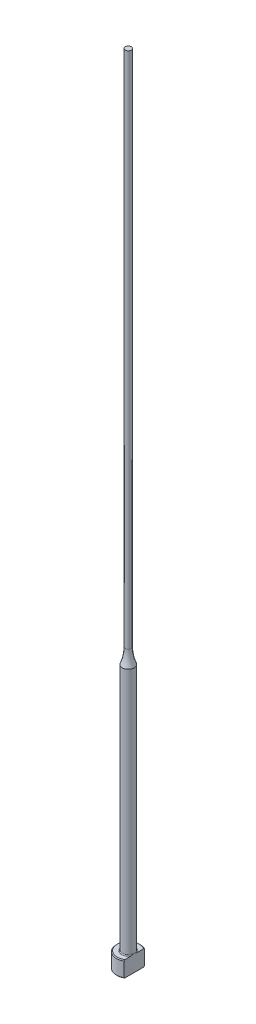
from build123d import *
from build123d.topology import SkipClean

# Parameters (mm, degrees)
CHAMFER1_SIZE    = 0.2
FILLET1_R        = 0.2
KEYED_HEAD_DEPTH = 201.044994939


with BuildPart() as part:
    # Sketch1 → Revolve1 (revolve)
    with BuildSketch(Plane.XY, mode=Mode.PRIVATE) as revolve1_sk:
        with BuildLine():
            Line((0, 0), (-3, 0))
            Line((-3, 0), (-3, 4))
            Line((-3, 4), (-1.5, 4))
            Line((-1.5, 4), (-1.5, 66.200328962))
            ThreePointArc((-1.5, 66.200328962), (-0.939291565, 68.063508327), (-0.75, 70))
            Line((-0.75, 70), (-0.75, 200))
            Line((-0.75, 200), (0, 200))
            Line((0, 200), (0, 0))
        make_face()
    revolve(revolve1_sk.sketch.rotate(Axis((0, 259.958771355, 0), (0, -1, 0)), 270), axis=Axis((0, 259.958771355, 0), (0, -1, 0)))

    # Chamfer1
    chamfer1_edges = [part.edges().sort_by_distance(p)[0] for p in [
        (0, 0, -3),
        (0, 4, -3),
    ]]
    chamfer(chamfer1_edges, length=CHAMFER1_SIZE)

    # Fillet1
    fillet1_edges = [part.edges().sort_by_distance(p)[0] for p in [
        (0, 4, -1.5),
    ]]
    fillet(fillet1_edges, radius=FILLET1_R)

    # Sketch2 → Keyed Head (cut, through all)
    with SkipClean():  # the faces are left unmerged after this step: merging them gives an invalid solid
        with BuildSketch(Plane(origin=(0, 0, 0), x_dir=(1, 0, 0), z_dir=(0, 1, 0))):
            with BuildLine():
                Line((1.5, -2.598076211), (1.5, 2.598076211))
                ThreePointArc((1.5, 2.598076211), (3, 0), (1.5, -2.598076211))
            make_face()
        extrude(amount=KEYED_HEAD_DEPTH, mode=Mode.SUBTRACT)


solid = part.part
